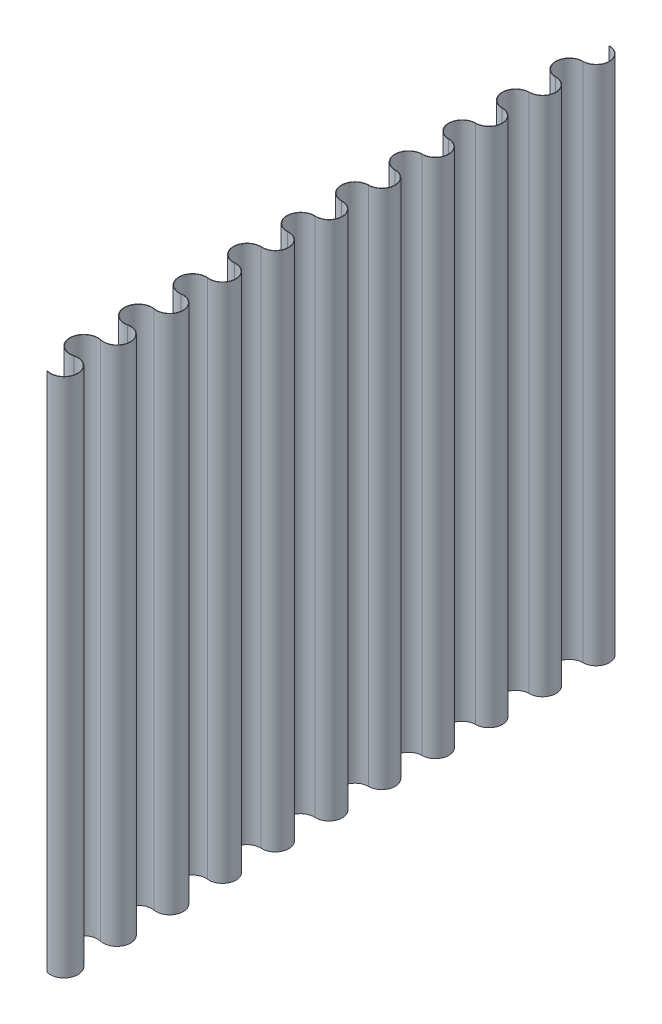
from build123d import *

# Parameters (mm, degrees)
BOSS_EXTRUDE1_DEPTH = 1727.2


with BuildPart() as part:
    # Sketch1 → Boss-Extrude1 (new, symmetric)
    with BuildSketch(Plane(origin=(0, 0, 0), x_dir=(1, 0, 0), z_dir=(0, 1, 0))):
        with BuildLine():
            Line((0, 1876.425), (0, 1873.884999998))
            ThreePointArc((0, 1873.884999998), (86.360000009, 1787.525000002), (9e-09, 1701.164999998))
            ThreePointArc((9e-09, 1701.164999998), (-91.439999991, 1609.724999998), (9e-09, 1518.284999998))
            ThreePointArc((9e-09, 1518.284999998), (86.360000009, 1431.924999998), (9e-09, 1345.564999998))
            ThreePointArc((9e-09, 1345.564999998), (-91.439999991, 1254.124999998), (9e-09, 1162.684999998))
            ThreePointArc((9e-09, 1162.684999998), (86.360000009, 1076.324999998), (9e-09, 989.964999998))
            ThreePointArc((9e-09, 989.964999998), (-91.439999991, 898.524999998), (9e-09, 807.084999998))
            ThreePointArc((9e-09, 807.084999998), (86.360000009, 720.724999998), (9e-09, 634.364999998))
            ThreePointArc((9e-09, 634.364999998), (-91.439999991, 542.924999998), (9e-09, 451.484999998))
            ThreePointArc((9e-09, 451.484999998), (86.360000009, 365.124999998), (9e-09, 278.764999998))
            ThreePointArc((9e-09, 278.764999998), (-91.448811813, 186.000445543), (2.61255663, 95.886036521))
            ThreePointArc((2.61255663, 95.886036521), (91.524028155, 8.235656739), (0.145054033, -76.839145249))
            ThreePointArc((0.145054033, -76.839145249), (-96.670510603, -168.275000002), (0.145054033, -259.710854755))
            ThreePointArc((0.145054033, -259.710854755), (91.59051062, -346.075000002), (0.145054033, -432.439145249))
            ThreePointArc((0.145054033, -432.439145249), (-96.757365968, -525.275390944), (2.757433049, -615.305676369))
            ThreePointArc((2.757433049, -615.305676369), (96.995699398, -703.042509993), (0.289634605, -788.051567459))
            ThreePointArc((0.289634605, -788.051567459), (-102.40213093, -880.956030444), (2.901599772, -970.889129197))
            ThreePointArc((2.901599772, -970.889129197), (102.824322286, -1058.725776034), (0.433269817, -1143.672226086))
            ThreePointArc((0.433269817, -1143.672226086), (-108.426244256, -1236.642089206), (3.044586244, -1326.464375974))
            ThreePointArc((3.044586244, -1326.464375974), (109.056517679, -1414.414807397), (0.575490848, -1499.301053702))
            ThreePointArc((0.575490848, -1499.301053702), (-114.880174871, -1592.334288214), (3.185925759, -1682.031497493))
            ThreePointArc((3.185925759, -1682.031497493), (115.74701397, -1770.11038592), (0.715833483, -1854.937956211))
            Line((0.715833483, -1854.937956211), (0, -1857.374999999))
            ThreePointArc((0, -1857.374999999), (118.286754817, -1770.146667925), (2.54, -1679.575))
            ThreePointArc((2.54, -1679.575), (-112.340434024, -1592.2980062), (0, -1501.774999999))
            ThreePointArc((0, -1501.774999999), (111.596258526, -1414.451089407), (2.54, -1323.975))
            ThreePointArc((2.54, -1323.975), (-105.886503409, -1236.605807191), (0, -1146.174999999))
            ThreePointArc((0, -1146.174999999), (105.364063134, -1058.762058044), (2.54, -968.375))
            ThreePointArc((2.54, -968.375), (-99.862390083, -880.919748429), (0, -790.574999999))
            ThreePointArc((0, -790.574999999), (99.535440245, -703.078792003), (2.54, -612.775))
            ThreePointArc((2.54, -612.775), (-94.217625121, -525.23910893), (0, -434.974999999))
            ThreePointArc((0, -434.974999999), (94.130510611, -346.074999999), (0, -257.174999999))
            ThreePointArc((0, -257.174999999), (-94.130510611, -168.275), (0, -79.375))
            ThreePointArc((0, -79.375), (94.063769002, 8.199374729), (2.54, 98.425))
            ThreePointArc((2.54, 98.425), (-88.909070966, 186.036727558), (0, 276.225))
            ThreePointArc((0, 276.225), (88.9, 365.125), (0, 454.025))
            ThreePointArc((0, 454.025), (-88.9, 542.925), (0, 631.825))
            ThreePointArc((0, 631.825), (88.9, 720.725), (0, 809.625))
            ThreePointArc((0, 809.625), (-88.9, 898.525), (0, 987.425))
            ThreePointArc((0, 987.425), (88.9, 1076.325), (0, 1165.225))
            ThreePointArc((0, 1165.225), (-88.9, 1254.125), (0, 1343.025))
            ThreePointArc((0, 1343.025), (88.9, 1431.925), (0, 1520.825))
            ThreePointArc((0, 1520.825), (-88.9, 1609.725), (0, 1698.625))
            ThreePointArc((0, 1698.625), (88.9, 1787.525), (0, 1876.425))
        make_face()
    extrude(amount=BOSS_EXTRUDE1_DEPTH, both=True)


solid = part.part
